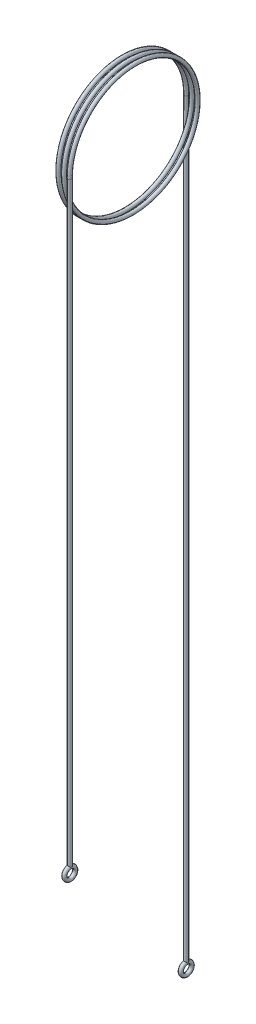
from build123d import *

# Parameters (mm, degrees)
SWEEP_1_PITCH       = 1.2
SWEEP_1_HEIGHT      = 3
SWEEP_1_RADIUS      = 13.9
SWEEP_1_START_ANGLE = 180
SKETCH_2_R          = 0.4
SKETCH_3_R          = 0.4
EXTRUDE_1_DEPTH     = 160
SKETCH_4_R          = 0.4
EXTRUDE_2_DEPTH     = 127
SKETCH_6_R          = 0.4
SKETCH_8_R          = 0.4


with BuildPart() as part:
    # Sweep 1: sweep along a helix
    with BuildLine() as sweep_1_path:
        add(Helix(SWEEP_1_PITCH, SWEEP_1_HEIGHT, SWEEP_1_RADIUS, center=(0, 0, 0), direction=(1, 0, 0), mode=Mode.PRIVATE).rotate(Axis((0, 0, 0), (1, 0, 0)), SWEEP_1_START_ANGLE))
    # Sketch 2 → Sweep 1 (sweep)
    with BuildSketch(Plane(origin=(0, 0, 0), x_dir=(1, 0, 0), z_dir=(0, 1, 0))):
        with Locations((0, 13.9)):
            Circle(SKETCH_2_R)
    sweep(path=sweep_1_path.line, is_frenet=True)

    # Sketch 3 → Extrude 1 (add)
    with BuildSketch(Plane(origin=(0, 0, 0), x_dir=(1, 0, 0), z_dir=(0, 1, 0))):
        with Locations(Location((0, 13.9, 0), (0, 0, 270))):
            Circle(SKETCH_3_R)
    extrude(amount=-EXTRUDE_1_DEPTH)

    # Sketch 4 → Extrude 2 (add)
    with BuildSketch(Plane(origin=(0, 0, 0), x_dir=(1, 0, 0), z_dir=(0, 1, 0))):
        with Locations(Location((3, -13.9, 0), (0, 0, 270))):
            Circle(SKETCH_4_R)
    extrude(amount=-EXTRUDE_2_DEPTH)

    # Sweep 2: sweep along a path in Sketch 5
    with BuildLine(Plane(origin=(0, 0, 0), x_dir=(0, 0, -1), z_dir=(1, 0, 0))) as sweep_2_path:
        CenterArc((13.9, -161.15), 1.15, 0, 360)
    # Sketch 6 → Sweep 2 (sweep)
    with BuildSketch(Plane(origin=(0, -161.15, 0), x_dir=(-1, 0, 0), z_dir=(0, 1, 0))):
        with Locations((0, -12.75)):
            Circle(SKETCH_6_R)
    sweep(path=sweep_2_path.line)

    # Sweep 3: sweep along a path in Sketch 7
    with BuildLine(Plane(origin=(3, 0, 0), x_dir=(0, 0, -1), z_dir=(1, 0, 0))) as sweep_3_path:
        CenterArc((-13.9, -128.15), 1.15, 0, 360)
    # Sketch 8 → Sweep 3 (sweep)
    with BuildSketch(Plane(origin=(0, -128.15, 0), x_dir=(-1, 0, 0), z_dir=(0, 1, 0))):
        with Locations((-3, 15.05)):
            Circle(SKETCH_8_R)
    sweep(path=sweep_3_path.line)


solid = part.part
